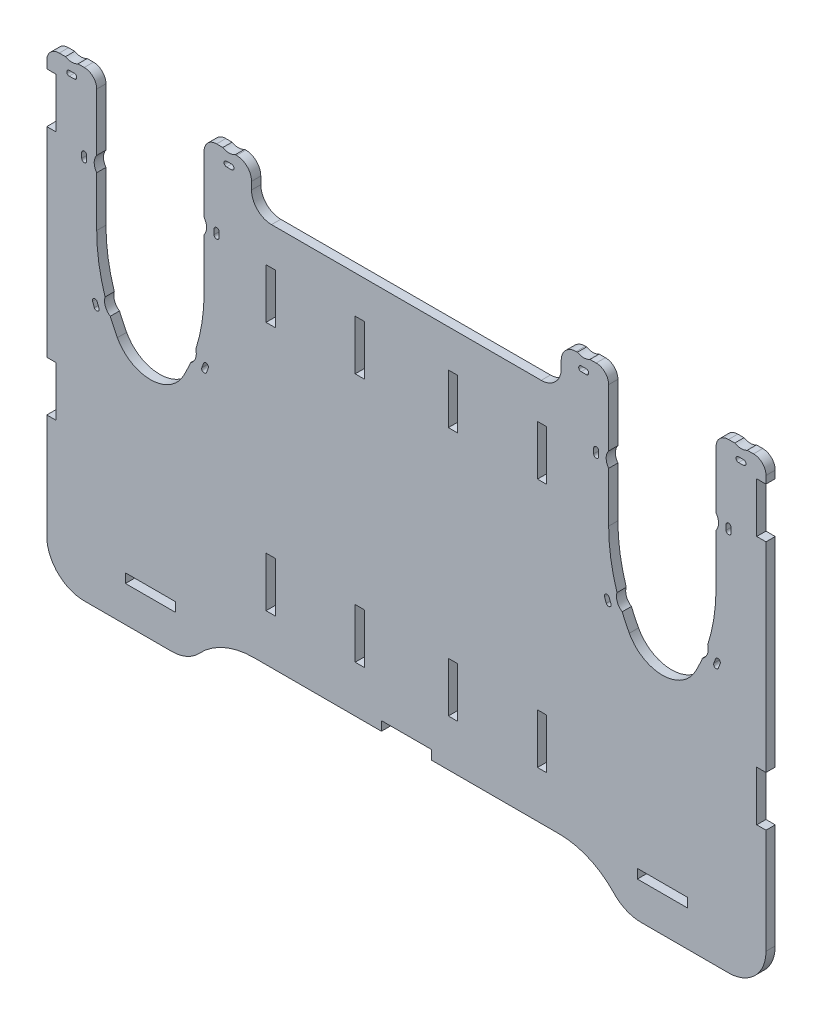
from build123d import *

# Parameters (mm, degrees)
SKETCH1_W      = 3.7
SKETCH1_H      = 20
SKETCH1_W_2    = 20
SKETCH1_H_2    = 3.7
EXTRUDE1_DEPTH = 3.7


with BuildPart() as part:
    # Sketch1 → Extrude1 (new body)
    with BuildSketch(Plane.XY):
        with BuildLine():
            Line((0, 150), (54, 150))
            ThreePointArc((54, 150), (59.656854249, 152.343145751), (62, 158))
            Line((62, 158), (62, 161))
            ThreePointArc((62, 161), (63.757359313, 165.242640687), (68, 167))
            Line((68, 167), (68.5, 167))
            ThreePointArc((68.5, 167), (71, 166.330127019), (73.5, 167))
            Line((73.5, 167), (76, 167))
            ThreePointArc((76, 167), (79.535533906, 165.535533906), (81, 162))
            Line((81, 162), (81, 139))
            ThreePointArc((81, 139), (80, 136), (81, 133))
            Line((81, 133), (81, 112.937424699))
            ThreePointArc((81, 112.937424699), (81.840573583, 102.121984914), (84.342106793, 91.566292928))
            ThreePointArc((84.342106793, 91.566292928), (84.441307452, 88.405571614), (86.417100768, 85.936514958))
            ThreePointArc((86.417100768, 85.936514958), (87.773455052, 82.89738452), (89.272727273, 79.9261569))
            ThreePointArc((89.272727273, 79.9261569), (102.5, 72), (115.727272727, 79.9261569))
            ThreePointArc((115.727272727, 79.9261569), (117.226544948, 82.89738452), (118.582899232, 85.936514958))
            ThreePointArc((118.582899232, 85.936514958), (120.558692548, 88.405571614), (120.657893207, 91.566292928))
            ThreePointArc((120.657893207, 91.566292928), (123.159426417, 102.121984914), (124, 112.937424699))
            Line((124, 112.937424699), (124, 133))
            ThreePointArc((124, 133), (125, 136), (124, 139))
            Line((124, 139), (124, 162))
            ThreePointArc((124, 162), (125.464466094, 165.535533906), (129, 167))
            Line((129, 167), (131.5, 167))
            ThreePointArc((131.5, 167), (134, 166.330127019), (136.5, 167))
            Line((136.5, 167), (139, 167))
            ThreePointArc((139, 167), (142.535533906, 165.535533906), (144, 162))
            Line((144, 162), (144, 159))
            Line((144, 159), (140.3, 159))
            Line((140.3, 159), (140.3, 139))
            Line((140.3, 139), (144, 139))
            Line((144, 139), (144, 59))
            Line((144, 59), (140.3, 59))
            Line((140.3, 59), (140.3, 39))
            Line((140.3, 39), (144, 39))
            Line((144, 39), (144, -3))
            ThreePointArc((144, -3), (139.606601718, -13.606601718), (129, -18))
            Line((129, -18), (94, -18))
            ThreePointArc((94, -18), (88.020869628, -16.756816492), (83.032826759, -13.233333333))
            ThreePointArc((83.032826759, -13.233333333), (73.056741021, -6.186367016), (61.098480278, -3.7))
            Line((61.098480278, -3.7), (10, -3.7))
            Line((10, -3.7), (10, 0))
            Line((10, 0), (0, 0))
            Line((0, 0), (0, 150))
        make_face()
        with Locations((18.65, 125)):
            Rectangle(SKETCH1_W, SKETCH1_H, mode=Mode.SUBTRACT)
        with Locations((54.35, 125)):
            Rectangle(SKETCH1_W, SKETCH1_H, mode=Mode.SUBTRACT)
        with BuildLine():
            Line((128, 135), (128, 137))
            ThreePointArc((128, 137), (129, 138), (130, 137))
            Line((130, 137), (130, 135))
            ThreePointArc((130, 135), (129, 134), (128, 135))
        make_face(mode=Mode.SUBTRACT)
        with BuildLine():
            Line((75, 135), (75, 137))
            ThreePointArc((75, 137), (76, 138), (77, 137))
            Line((77, 137), (77, 135))
            ThreePointArc((77, 135), (76, 134), (75, 135))
        make_face(mode=Mode.SUBTRACT)
        with BuildLine():
            Line((80.035311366, 85.715871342), (79.343646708, 87.592463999))
            ThreePointArc((79.343646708, 87.592463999), (79.936110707, 88.876592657), (81.220239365, 88.284128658))
            Line((81.220239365, 88.284128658), (81.911904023, 86.407536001))
            ThreePointArc((81.911904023, 86.407536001), (81.319440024, 85.123407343), (80.035311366, 85.715871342))
        make_face(mode=Mode.SUBTRACT)
        with BuildLine():
            Line((123.088095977, 86.407536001), (123.779760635, 88.284128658))
            ThreePointArc((123.779760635, 88.284128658), (125.063889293, 88.876592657), (125.656353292, 87.592463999))
            Line((125.656353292, 87.592463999), (124.964688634, 85.715871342))
            ThreePointArc((124.964688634, 85.715871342), (123.680559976, 85.123407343), (123.088095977, 86.407536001))
        make_face(mode=Mode.SUBTRACT)
        with BuildLine():
            Line((72, 161), (70, 161))
            ThreePointArc((70, 161), (69, 162), (70, 163))
            Line((70, 163), (72, 163))
            ThreePointArc((72, 163), (73, 162), (72, 161))
        make_face(mode=Mode.SUBTRACT)
        with BuildLine():
            Line((133, 163), (135, 163))
            ThreePointArc((135, 163), (136, 162), (135, 161))
            Line((135, 161), (133, 161))
            ThreePointArc((133, 161), (132, 162), (133, 163))
        make_face(mode=Mode.SUBTRACT)
        with Locations((102.5, -1.85)):
            Rectangle(SKETCH1_W_2, SKETCH1_H_2, mode=Mode.SUBTRACT)
        with Locations((18.65, 25)):
            Rectangle(SKETCH1_W, SKETCH1_H, mode=Mode.SUBTRACT)
        with Locations((54.35, 25)):
            Rectangle(SKETCH1_W, SKETCH1_H, mode=Mode.SUBTRACT)
    extrude1 = extrude(amount=EXTRUDE1_DEPTH)

    # Mirror1: Extrude1 across plane
    add(extrude1.mirror(Plane(origin=(0, 0, 0), x_dir=(0, 0, 1), z_dir=(1, 0, 0))))


solid = part.part
